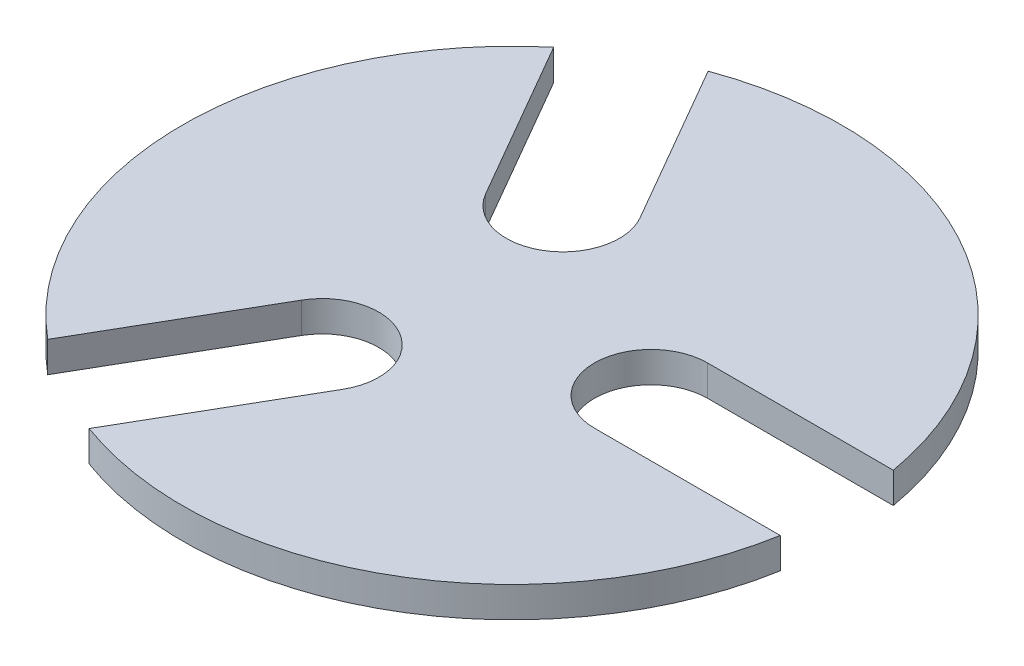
ISO-10303-21;
HEADER;
FILE_DESCRIPTION(('STEP AP214'),'2;1');
FILE_NAME('part.step','',(''),(''),'','','');
FILE_SCHEMA(('AUTOMOTIVE_DESIGN { 1 0 10303 214 1 1 1 1 }'));
ENDSEC;
DATA;
#1=APPLICATION_CONTEXT('core data for automotive mechanical design processes');
#2=APPLICATION_PROTOCOL_DEFINITION('international standard','automotive_design',2000,#1);
#3=PRODUCT_CONTEXT('',#1,'mechanical');
#4=PRODUCT('Part','Part','',(#3));
#5=PRODUCT_RELATED_PRODUCT_CATEGORY('part','',(#4));
#6=PRODUCT_DEFINITION_FORMATION('','',#4);
#7=PRODUCT_DEFINITION_CONTEXT('part definition',#1,'design');
#8=PRODUCT_DEFINITION('design','',#6,#7);
#9=PRODUCT_DEFINITION_SHAPE('','',#8);
#10=(LENGTH_UNIT() NAMED_UNIT(*) SI_UNIT(.MILLI.,.METRE.));
#11=(NAMED_UNIT(*) PLANE_ANGLE_UNIT() SI_UNIT($,.RADIAN.));
#12=(NAMED_UNIT(*) SI_UNIT($,.STERADIAN.) SOLID_ANGLE_UNIT());
#13=UNCERTAINTY_MEASURE_WITH_UNIT(LENGTH_MEASURE(1.E-05),#10,'distance_accuracy_value','');
#14=(GEOMETRIC_REPRESENTATION_CONTEXT(3) GLOBAL_UNCERTAINTY_ASSIGNED_CONTEXT((#13)) GLOBAL_UNIT_ASSIGNED_CONTEXT((#10,
#11,#12)) REPRESENTATION_CONTEXT('',''));
#15=CARTESIAN_POINT('',(0.,0.,0.));
#16=DIRECTION('',(0.,0.,1.));
#17=DIRECTION('',(1.,0.,0.));
#18=AXIS2_PLACEMENT_3D('',#15,#16,#17);
#19=CARTESIAN_POINT('',(0.,1.1811,0.));
#20=DIRECTION('',(0.,-1.,0.));
#21=DIRECTION('',(0.,0.,-1.));
#22=AXIS2_PLACEMENT_3D('',#19,#20,#21);
#23=CYLINDRICAL_SURFACE('',#22,25.4);
#24=CARTESIAN_POINT('',(0.,1.1811,0.));
#25=DIRECTION('',(0.,1.,0.));
#26=DIRECTION('',(0.,0.,1.));
#27=AXIS2_PLACEMENT_3D('',#24,#25,#26);
#28=CIRCLE('',#27,25.4);
#29=CARTESIAN_POINT('',(-16.2843315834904,1.1811,-19.4930896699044));
#30=VERTEX_POINT('',#29);
#31=CARTESIAN_POINT('',(-16.2843315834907,1.1811,19.4930896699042));
#32=VERTEX_POINT('',#31);
#33=EDGE_CURVE('E42',#30,#32,#28,.T.);
#34=ORIENTED_EDGE('',*,*,#33,.F.);
#35=DIRECTION('',(0.,1.,0.));
#36=VECTOR('',#35,1.);
#37=CARTESIAN_POINT('',(-16.2843315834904,-1.1811,-19.4930896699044));
#38=LINE('',#37,#36);
#39=CARTESIAN_POINT('',(-16.2843315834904,-1.1811,-19.4930896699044));
#40=VERTEX_POINT('',#39);
#41=EDGE_CURVE('E156',#40,#30,#38,.T.);
#42=ORIENTED_EDGE('',*,*,#41,.F.);
#43=CARTESIAN_POINT('',(0.,-1.1811,0.));
#44=DIRECTION('',(0.,1.,0.));
#45=DIRECTION('',(0.,0.,1.));
#46=AXIS2_PLACEMENT_3D('',#43,#44,#45);
#47=CIRCLE('',#46,25.4);
#48=CARTESIAN_POINT('',(-16.2843315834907,-1.1811,19.4930896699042));
#49=VERTEX_POINT('',#48);
#50=EDGE_CURVE('E58',#40,#49,#47,.T.);
#51=ORIENTED_EDGE('',*,*,#50,.T.);
#52=DIRECTION('',(0.,1.,0.));
#53=VECTOR('',#52,1.);
#54=CARTESIAN_POINT('',(-16.2843315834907,-1.1811,19.4930896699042));
#55=LINE('',#54,#53);
#56=EDGE_CURVE('E182',#49,#32,#55,.T.);
#57=ORIENTED_EDGE('',*,*,#56,.T.);
#58=EDGE_LOOP('',(#34,#42,#51,#57));
#59=FACE_BOUND('',#58,.T.);
#60=ADVANCED_FACE('F33',(#59),#23,.T.);
#61=CARTESIAN_POINT('',(-8.73934506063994,1.1811,23.8491896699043));
#62=VERTEX_POINT('',#61);
#63=CARTESIAN_POINT('',(25.0236766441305,1.1811,4.3561));
#64=VERTEX_POINT('',#63);
#65=EDGE_CURVE('E43',#62,#64,#28,.T.);
#66=ORIENTED_EDGE('',*,*,#65,.F.);
#67=DIRECTION('',(0.,1.,0.));
#68=VECTOR('',#67,1.);
#69=CARTESIAN_POINT('',(-8.73934506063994,-1.1811,23.8491896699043));
#70=LINE('',#69,#68);
#71=CARTESIAN_POINT('',(-8.73934506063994,-1.1811,23.8491896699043));
#72=VERTEX_POINT('',#71);
#73=EDGE_CURVE('E180',#72,#62,#70,.T.);
#74=ORIENTED_EDGE('',*,*,#73,.F.);
#75=CARTESIAN_POINT('',(25.0236766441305,-1.1811,4.3561));
#76=VERTEX_POINT('',#75);
#77=EDGE_CURVE('E205',#72,#76,#47,.T.);
#78=ORIENTED_EDGE('',*,*,#77,.T.);
#79=DIRECTION('',(0.,1.,0.));
#80=VECTOR('',#79,1.);
#81=CARTESIAN_POINT('',(25.0236766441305,-1.1811,4.3561));
#82=LINE('',#81,#80);
#83=EDGE_CURVE('E208',#76,#64,#82,.T.);
#84=ORIENTED_EDGE('',*,*,#83,.T.);
#85=EDGE_LOOP('',(#66,#74,#78,#84));
#86=FACE_BOUND('',#85,.T.);
#87=ADVANCED_FACE('F232',(#86),#23,.T.);
#88=CARTESIAN_POINT('',(25.0236766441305,-1.1811,-4.3561));
#89=VERTEX_POINT('',#88);
#90=CARTESIAN_POINT('',(-8.73934506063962,-1.1811,-23.8491896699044));
#91=VERTEX_POINT('',#90);
#92=EDGE_CURVE('E37',#89,#91,#47,.T.);
#93=ORIENTED_EDGE('',*,*,#92,.T.);
#94=DIRECTION('',(0.,1.,0.));
#95=VECTOR('',#94,1.);
#96=CARTESIAN_POINT('',(-8.73934506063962,-1.1811,-23.8491896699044));
#97=LINE('',#96,#95);
#98=CARTESIAN_POINT('',(-8.73934506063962,1.1811,-23.8491896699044));
#99=VERTEX_POINT('',#98);
#100=EDGE_CURVE('E50',#91,#99,#97,.T.);
#101=ORIENTED_EDGE('',*,*,#100,.T.);
#102=CARTESIAN_POINT('',(25.0236766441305,1.1811,-4.3561));
#103=VERTEX_POINT('',#102);
#104=EDGE_CURVE('E11',#103,#99,#28,.T.);
#105=ORIENTED_EDGE('',*,*,#104,.F.);
#106=DIRECTION('',(0.,1.,0.));
#107=VECTOR('',#106,1.);
#108=CARTESIAN_POINT('',(25.0236766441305,-1.1811,-4.3561));
#109=LINE('',#108,#107);
#110=EDGE_CURVE('E206',#89,#103,#109,.T.);
#111=ORIENTED_EDGE('',*,*,#110,.F.);
#112=EDGE_LOOP('',(#93,#101,#105,#111));
#113=FACE_BOUND('',#112,.T.);
#114=ADVANCED_FACE('F35',(#113),#23,.T.);
#115=CARTESIAN_POINT('',(0.,1.1811,0.));
#116=DIRECTION('',(0.,1.,0.));
#117=DIRECTION('',(0.,0.,1.));
#118=AXIS2_PLACEMENT_3D('',#115,#116,#117);
#119=PLANE('',#118);
#120=DIRECTION('',(0.499999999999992,0.,0.866025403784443));
#121=VECTOR('',#120,1.);
#122=CARTESIAN_POINT('',(-16.2843315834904,1.1811,-19.4930896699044));
#123=LINE('',#122,#121);
#124=CARTESIAN_POINT('',(-9.12554326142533,1.1811,-7.09370457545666));
#125=VERTEX_POINT('',#124);
#126=EDGE_CURVE('E144',#30,#125,#123,.T.);
#127=ORIENTED_EDGE('',*,*,#126,.F.);
#128=ORIENTED_EDGE('',*,*,#33,.T.);
#129=DIRECTION('',(-0.500000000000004,0.,0.866025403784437));
#130=VECTOR('',#129,1.);
#131=CARTESIAN_POINT('',(-16.2843315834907,1.1811,19.4930896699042));
#132=LINE('',#131,#130);
#133=CARTESIAN_POINT('',(-9.12554326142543,1.1811,7.09370457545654));
#134=VERTEX_POINT('',#133);
#135=EDGE_CURVE('E172',#134,#32,#132,.T.);
#136=ORIENTED_EDGE('',*,*,#135,.F.);
#137=CARTESIAN_POINT('',(-5.35305000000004,1.1811,9.27175457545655));
#138=DIRECTION('',(0.,1.,0.));
#139=DIRECTION('',(-0.866025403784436,0.,-0.500000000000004));
#140=AXIS2_PLACEMENT_3D('',#137,#138,#139);
#141=CIRCLE('',#140,4.3561);
#142=CARTESIAN_POINT('',(-1.58055673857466,1.1811,11.4498045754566));
#143=VERTEX_POINT('',#142);
#144=EDGE_CURVE('E155',#143,#134,#141,.T.);
#145=ORIENTED_EDGE('',*,*,#144,.F.);
#146=DIRECTION('',(0.500000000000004,0.,-0.866025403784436));
#147=VECTOR('',#146,1.);
#148=CARTESIAN_POINT('',(-8.73934506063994,1.1811,23.8491896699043));
#149=LINE('',#148,#147);
#150=EDGE_CURVE('E163',#62,#143,#149,.T.);
#151=ORIENTED_EDGE('',*,*,#150,.F.);
#152=ORIENTED_EDGE('',*,*,#65,.T.);
#153=DIRECTION('',(1.,0.,0.));
#154=VECTOR('',#153,1.);
#155=CARTESIAN_POINT('',(25.0236766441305,1.1811,4.3561));
#156=LINE('',#155,#154);
#157=CARTESIAN_POINT('',(10.7061,1.1811,4.3561));
#158=VERTEX_POINT('',#157);
#159=EDGE_CURVE('E198',#158,#64,#156,.T.);
#160=ORIENTED_EDGE('',*,*,#159,.F.);
#161=CARTESIAN_POINT('',(10.7061,1.1811,0.));
#162=DIRECTION('',(0.,1.,0.));
#163=DIRECTION('',(0.,0.,1.));
#164=AXIS2_PLACEMENT_3D('',#161,#162,#163);
#165=CIRCLE('',#164,4.3561);
#166=CARTESIAN_POINT('',(10.7061,1.1811,-4.3561));
#167=VERTEX_POINT('',#166);
#168=EDGE_CURVE('E179',#167,#158,#165,.T.);
#169=ORIENTED_EDGE('',*,*,#168,.F.);
#170=DIRECTION('',(-1.,0.,0.));
#171=VECTOR('',#170,1.);
#172=CARTESIAN_POINT('',(25.0236766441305,1.1811,-4.3561));
#173=LINE('',#172,#171);
#174=EDGE_CURVE('E189',#103,#167,#173,.T.);
#175=ORIENTED_EDGE('',*,*,#174,.F.);
#176=ORIENTED_EDGE('',*,*,#104,.T.);
#177=DIRECTION('',(-0.499999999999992,0.,-0.866025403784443));
#178=VECTOR('',#177,1.);
#179=CARTESIAN_POINT('',(-8.73934506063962,1.1811,-23.8491896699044));
#180=LINE('',#179,#178);
#181=CARTESIAN_POINT('',(-1.5805567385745,1.1811,-11.4498045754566));
#182=VERTEX_POINT('',#181);
#183=EDGE_CURVE('E147',#182,#99,#180,.T.);
#184=ORIENTED_EDGE('',*,*,#183,.F.);
#185=CARTESIAN_POINT('',(-5.35304999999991,1.1811,-9.27175457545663));
#186=DIRECTION('',(0.,1.,0.));
#187=DIRECTION('',(0.866025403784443,0.,-0.499999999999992));
#188=AXIS2_PLACEMENT_3D('',#185,#186,#187);
#189=CIRCLE('',#188,4.3561);
#190=EDGE_CURVE('E133',#125,#182,#189,.T.);
#191=ORIENTED_EDGE('',*,*,#190,.F.);
#192=EDGE_LOOP('',(#127,#128,#136,#145,#151,#152,#160,#169,#175,#176,#184,#191));
#193=FACE_BOUND('',#192,.T.);
#194=ADVANCED_FACE('F223',(#193),#119,.T.);
#195=CARTESIAN_POINT('',(0.,-1.1811,0.));
#196=DIRECTION('',(0.,1.,0.));
#197=DIRECTION('',(0.,0.,1.));
#198=AXIS2_PLACEMENT_3D('',#195,#196,#197);
#199=PLANE('',#198);
#200=ORIENTED_EDGE('',*,*,#50,.F.);
#201=DIRECTION('',(0.499999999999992,0.,0.866025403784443));
#202=VECTOR('',#201,1.);
#203=CARTESIAN_POINT('',(-16.2843315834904,-1.1811,-19.4930896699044));
#204=LINE('',#203,#202);
#205=CARTESIAN_POINT('',(-9.12554326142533,-1.1811,-7.09370457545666));
#206=VERTEX_POINT('',#205);
#207=EDGE_CURVE('E135',#40,#206,#204,.T.);
#208=ORIENTED_EDGE('',*,*,#207,.T.);
#209=CARTESIAN_POINT('',(-5.35304999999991,-1.1811,-9.27175457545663));
#210=DIRECTION('',(0.,1.,0.));
#211=DIRECTION('',(0.866025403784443,0.,-0.499999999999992));
#212=AXIS2_PLACEMENT_3D('',#209,#210,#211);
#213=CIRCLE('',#212,4.3561);
#214=CARTESIAN_POINT('',(-1.5805567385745,-1.1811,-11.4498045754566));
#215=VERTEX_POINT('',#214);
#216=EDGE_CURVE('E130',#206,#215,#213,.T.);
#217=ORIENTED_EDGE('',*,*,#216,.T.);
#218=DIRECTION('',(-0.499999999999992,0.,-0.866025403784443));
#219=VECTOR('',#218,1.);
#220=CARTESIAN_POINT('',(-8.73934506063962,-1.1811,-23.8491896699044));
#221=LINE('',#220,#219);
#222=EDGE_CURVE('E137',#215,#91,#221,.T.);
#223=ORIENTED_EDGE('',*,*,#222,.T.);
#224=ORIENTED_EDGE('',*,*,#92,.F.);
#225=DIRECTION('',(-1.,0.,0.));
#226=VECTOR('',#225,1.);
#227=CARTESIAN_POINT('',(25.0236766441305,-1.1811,-4.3561));
#228=LINE('',#227,#226);
#229=CARTESIAN_POINT('',(10.7061,-1.1811,-4.3561));
#230=VERTEX_POINT('',#229);
#231=EDGE_CURVE('E192',#89,#230,#228,.T.);
#232=ORIENTED_EDGE('',*,*,#231,.T.);
#233=CARTESIAN_POINT('',(10.7061,-1.1811,0.));
#234=DIRECTION('',(0.,1.,0.));
#235=DIRECTION('',(0.,0.,1.));
#236=AXIS2_PLACEMENT_3D('',#233,#234,#235);
#237=CIRCLE('',#236,4.3561);
#238=CARTESIAN_POINT('',(10.7061,-1.1811,4.3561));
#239=VERTEX_POINT('',#238);
#240=EDGE_CURVE('E185',#230,#239,#237,.T.);
#241=ORIENTED_EDGE('',*,*,#240,.T.);
#242=DIRECTION('',(1.,0.,0.));
#243=VECTOR('',#242,1.);
#244=CARTESIAN_POINT('',(25.0236766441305,-1.1811,4.3561));
#245=LINE('',#244,#243);
#246=EDGE_CURVE('E188',#239,#76,#245,.T.);
#247=ORIENTED_EDGE('',*,*,#246,.T.);
#248=ORIENTED_EDGE('',*,*,#77,.F.);
#249=DIRECTION('',(0.500000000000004,0.,-0.866025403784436));
#250=VECTOR('',#249,1.);
#251=CARTESIAN_POINT('',(-8.73934506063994,-1.1811,23.8491896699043));
#252=LINE('',#251,#250);
#253=CARTESIAN_POINT('',(-1.58055673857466,-1.1811,11.4498045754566));
#254=VERTEX_POINT('',#253);
#255=EDGE_CURVE('E166',#72,#254,#252,.T.);
#256=ORIENTED_EDGE('',*,*,#255,.T.);
#257=CARTESIAN_POINT('',(-5.35305000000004,-1.1811,9.27175457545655));
#258=DIRECTION('',(0.,1.,0.));
#259=DIRECTION('',(-0.866025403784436,0.,-0.500000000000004));
#260=AXIS2_PLACEMENT_3D('',#257,#258,#259);
#261=CIRCLE('',#260,4.3561);
#262=CARTESIAN_POINT('',(-9.12554326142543,-1.1811,7.09370457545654));
#263=VERTEX_POINT('',#262);
#264=EDGE_CURVE('E159',#254,#263,#261,.T.);
#265=ORIENTED_EDGE('',*,*,#264,.T.);
#266=DIRECTION('',(-0.500000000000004,0.,0.866025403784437));
#267=VECTOR('',#266,1.);
#268=CARTESIAN_POINT('',(-16.2843315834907,-1.1811,19.4930896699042));
#269=LINE('',#268,#267);
#270=EDGE_CURVE('E162',#263,#49,#269,.T.);
#271=ORIENTED_EDGE('',*,*,#270,.T.);
#272=EDGE_LOOP('',(#200,#208,#217,#223,#224,#232,#241,#247,#248,#256,#265,#271));
#273=FACE_BOUND('',#272,.T.);
#274=ADVANCED_FACE('F143',(#273),#199,.F.);
#275=CARTESIAN_POINT('',(10.7061,-1.1811,0.));
#276=DIRECTION('',(0.,1.,0.));
#277=DIRECTION('',(0.,0.,1.));
#278=AXIS2_PLACEMENT_3D('',#275,#276,#277);
#279=CYLINDRICAL_SURFACE('',#278,4.3561);
#280=ORIENTED_EDGE('',*,*,#168,.T.);
#281=DIRECTION('',(0.,1.,0.));
#282=VECTOR('',#281,1.);
#283=CARTESIAN_POINT('',(10.7061,-1.1811,4.3561));
#284=LINE('',#283,#282);
#285=EDGE_CURVE('E195',#239,#158,#284,.T.);
#286=ORIENTED_EDGE('',*,*,#285,.F.);
#287=ORIENTED_EDGE('',*,*,#240,.F.);
#288=DIRECTION('',(0.,1.,0.));
#289=VECTOR('',#288,1.);
#290=CARTESIAN_POINT('',(10.7061,-1.1811,-4.3561));
#291=LINE('',#290,#289);
#292=EDGE_CURVE('E203',#230,#167,#291,.T.);
#293=ORIENTED_EDGE('',*,*,#292,.T.);
#294=EDGE_LOOP('',(#280,#286,#287,#293));
#295=FACE_BOUND('',#294,.T.);
#296=ADVANCED_FACE('F219',(#295),#279,.F.);
#297=CARTESIAN_POINT('',(25.0236766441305,-1.1811,-4.3561));
#298=DIRECTION('',(0.,0.,-1.));
#299=DIRECTION('',(-1.,0.,0.));
#300=AXIS2_PLACEMENT_3D('',#297,#298,#299);
#301=PLANE('',#300);
#302=ORIENTED_EDGE('',*,*,#174,.T.);
#303=ORIENTED_EDGE('',*,*,#292,.F.);
#304=ORIENTED_EDGE('',*,*,#231,.F.);
#305=ORIENTED_EDGE('',*,*,#110,.T.);
#306=EDGE_LOOP('',(#302,#303,#304,#305));
#307=FACE_BOUND('',#306,.T.);
#308=ADVANCED_FACE('F234',(#307),#301,.F.);
#309=CARTESIAN_POINT('',(25.0236766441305,-1.1811,4.3561));
#310=DIRECTION('',(0.,0.,1.));
#311=DIRECTION('',(1.,0.,0.));
#312=AXIS2_PLACEMENT_3D('',#309,#310,#311);
#313=PLANE('',#312);
#314=ORIENTED_EDGE('',*,*,#159,.T.);
#315=ORIENTED_EDGE('',*,*,#83,.F.);
#316=ORIENTED_EDGE('',*,*,#246,.F.);
#317=ORIENTED_EDGE('',*,*,#285,.T.);
#318=EDGE_LOOP('',(#314,#315,#316,#317));
#319=FACE_BOUND('',#318,.T.);
#320=ADVANCED_FACE('F213',(#319),#313,.F.);
#321=CARTESIAN_POINT('',(-5.35305000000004,-1.1811,9.27175457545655));
#322=DIRECTION('',(0.,1.,0.));
#323=DIRECTION('',(0.,0.,1.));
#324=AXIS2_PLACEMENT_3D('',#321,#322,#323);
#325=CYLINDRICAL_SURFACE('',#324,4.3561);
#326=ORIENTED_EDGE('',*,*,#144,.T.);
#327=DIRECTION('',(0.,1.,0.));
#328=VECTOR('',#327,1.);
#329=CARTESIAN_POINT('',(-9.12554326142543,-1.1811,7.09370457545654));
#330=LINE('',#329,#328);
#331=EDGE_CURVE('E169',#263,#134,#330,.T.);
#332=ORIENTED_EDGE('',*,*,#331,.F.);
#333=ORIENTED_EDGE('',*,*,#264,.F.);
#334=DIRECTION('',(0.,1.,0.));
#335=VECTOR('',#334,1.);
#336=CARTESIAN_POINT('',(-1.58055673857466,-1.1811,11.4498045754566));
#337=LINE('',#336,#335);
#338=EDGE_CURVE('E177',#254,#143,#337,.T.);
#339=ORIENTED_EDGE('',*,*,#338,.T.);
#340=EDGE_LOOP('',(#326,#332,#333,#339));
#341=FACE_BOUND('',#340,.T.);
#342=ADVANCED_FACE('F244',(#341),#325,.F.);
#343=CARTESIAN_POINT('',(-8.73934506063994,-1.1811,23.8491896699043));
#344=DIRECTION('',(0.866025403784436,0.,0.500000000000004));
#345=DIRECTION('',(0.500000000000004,0.,-0.866025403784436));
#346=AXIS2_PLACEMENT_3D('',#343,#344,#345);
#347=PLANE('',#346);
#348=ORIENTED_EDGE('',*,*,#150,.T.);
#349=ORIENTED_EDGE('',*,*,#338,.F.);
#350=ORIENTED_EDGE('',*,*,#255,.F.);
#351=ORIENTED_EDGE('',*,*,#73,.T.);
#352=EDGE_LOOP('',(#348,#349,#350,#351));
#353=FACE_BOUND('',#352,.T.);
#354=ADVANCED_FACE('F246',(#353),#347,.F.);
#355=CARTESIAN_POINT('',(-16.2843315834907,-1.1811,19.4930896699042));
#356=DIRECTION('',(-0.866025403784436,0.,-0.500000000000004));
#357=DIRECTION('',(-0.500000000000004,0.,0.866025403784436));
#358=AXIS2_PLACEMENT_3D('',#355,#356,#357);
#359=PLANE('',#358);
#360=ORIENTED_EDGE('',*,*,#135,.T.);
#361=ORIENTED_EDGE('',*,*,#56,.F.);
#362=ORIENTED_EDGE('',*,*,#270,.F.);
#363=ORIENTED_EDGE('',*,*,#331,.T.);
#364=EDGE_LOOP('',(#360,#361,#362,#363));
#365=FACE_BOUND('',#364,.T.);
#366=ADVANCED_FACE('F241',(#365),#359,.F.);
#367=CARTESIAN_POINT('',(-5.35304999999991,-1.1811,-9.27175457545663));
#368=DIRECTION('',(0.,1.,0.));
#369=DIRECTION('',(0.,0.,1.));
#370=AXIS2_PLACEMENT_3D('',#367,#368,#369);
#371=CYLINDRICAL_SURFACE('',#370,4.3561);
#372=ORIENTED_EDGE('',*,*,#190,.T.);
#373=DIRECTION('',(0.,1.,0.));
#374=VECTOR('',#373,1.);
#375=CARTESIAN_POINT('',(-1.5805567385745,-1.1811,-11.4498045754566));
#376=LINE('',#375,#374);
#377=EDGE_CURVE('E127',#215,#182,#376,.T.);
#378=ORIENTED_EDGE('',*,*,#377,.F.);
#379=ORIENTED_EDGE('',*,*,#216,.F.);
#380=DIRECTION('',(0.,1.,0.));
#381=VECTOR('',#380,1.);
#382=CARTESIAN_POINT('',(-9.12554326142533,-1.1811,-7.09370457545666));
#383=LINE('',#382,#381);
#384=EDGE_CURVE('E153',#206,#125,#383,.T.);
#385=ORIENTED_EDGE('',*,*,#384,.T.);
#386=EDGE_LOOP('',(#372,#378,#379,#385));
#387=FACE_BOUND('',#386,.T.);
#388=ADVANCED_FACE('F128',(#387),#371,.F.);
#389=CARTESIAN_POINT('',(-16.2843315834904,-1.1811,-19.4930896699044));
#390=DIRECTION('',(-0.866025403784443,0.,0.499999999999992));
#391=DIRECTION('',(0.499999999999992,0.,0.866025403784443));
#392=AXIS2_PLACEMENT_3D('',#389,#390,#391);
#393=PLANE('',#392);
#394=ORIENTED_EDGE('',*,*,#126,.T.);
#395=ORIENTED_EDGE('',*,*,#384,.F.);
#396=ORIENTED_EDGE('',*,*,#207,.F.);
#397=ORIENTED_EDGE('',*,*,#41,.T.);
#398=EDGE_LOOP('',(#394,#395,#396,#397));
#399=FACE_BOUND('',#398,.T.);
#400=ADVANCED_FACE('F309',(#399),#393,.F.);
#401=CARTESIAN_POINT('',(-8.73934506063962,-1.1811,-23.8491896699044));
#402=DIRECTION('',(0.866025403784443,0.,-0.499999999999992));
#403=DIRECTION('',(-0.499999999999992,0.,-0.866025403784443));
#404=AXIS2_PLACEMENT_3D('',#401,#402,#403);
#405=PLANE('',#404);
#406=ORIENTED_EDGE('',*,*,#183,.T.);
#407=ORIENTED_EDGE('',*,*,#100,.F.);
#408=ORIENTED_EDGE('',*,*,#222,.F.);
#409=ORIENTED_EDGE('',*,*,#377,.T.);
#410=EDGE_LOOP('',(#406,#407,#408,#409));
#411=FACE_BOUND('',#410,.T.);
#412=ADVANCED_FACE('F138',(#411),#405,.F.);
#413=CLOSED_SHELL('',(#60,#87,#114,#194,#274,#296,#308,#320,#342,#354,#366,#388,#400,#412));
#414=MANIFOLD_SOLID_BREP('B2',#413);
#415=ADVANCED_BREP_SHAPE_REPRESENTATION('',(#18,#414),#14);
#416=SHAPE_DEFINITION_REPRESENTATION(#9,#415);
ENDSEC;
END-ISO-10303-21;
